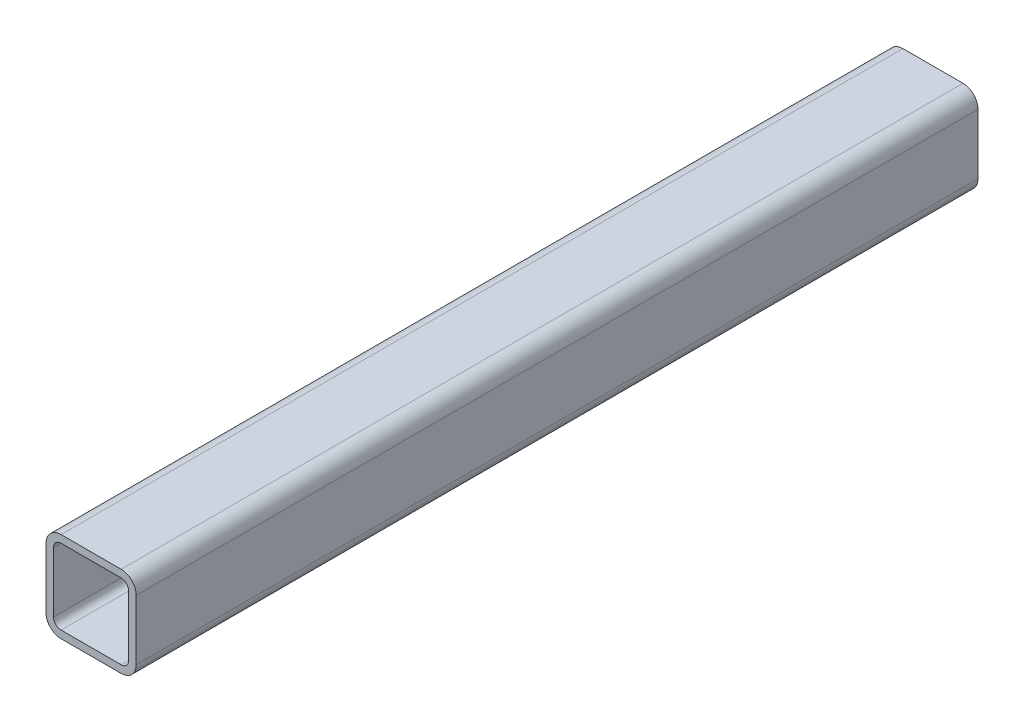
ISO-10303-21;
HEADER;
FILE_DESCRIPTION(('STEP AP214'),'2;1');
FILE_NAME('part.step','',(''),(''),'','','');
FILE_SCHEMA(('AUTOMOTIVE_DESIGN { 1 0 10303 214 1 1 1 1 }'));
ENDSEC;
DATA;
#1=APPLICATION_CONTEXT('core data for automotive mechanical design processes');
#2=APPLICATION_PROTOCOL_DEFINITION('international standard','automotive_design',2000,#1);
#3=PRODUCT_CONTEXT('',#1,'mechanical');
#4=PRODUCT('Part','Part','',(#3));
#5=PRODUCT_RELATED_PRODUCT_CATEGORY('part','',(#4));
#6=PRODUCT_DEFINITION_FORMATION('','',#4);
#7=PRODUCT_DEFINITION_CONTEXT('part definition',#1,'design');
#8=PRODUCT_DEFINITION('design','',#6,#7);
#9=PRODUCT_DEFINITION_SHAPE('','',#8);
#10=(LENGTH_UNIT() NAMED_UNIT(*) SI_UNIT(.MILLI.,.METRE.));
#11=(NAMED_UNIT(*) PLANE_ANGLE_UNIT() SI_UNIT($,.RADIAN.));
#12=(NAMED_UNIT(*) SI_UNIT($,.STERADIAN.) SOLID_ANGLE_UNIT());
#13=UNCERTAINTY_MEASURE_WITH_UNIT(LENGTH_MEASURE(1.E-05),#10,'distance_accuracy_value','');
#14=(GEOMETRIC_REPRESENTATION_CONTEXT(3) GLOBAL_UNCERTAINTY_ASSIGNED_CONTEXT((#13)) GLOBAL_UNIT_ASSIGNED_CONTEXT((#10,
#11,#12)) REPRESENTATION_CONTEXT('',''));
#15=CARTESIAN_POINT('',(0.,0.,0.));
#16=DIRECTION('',(0.,0.,1.));
#17=DIRECTION('',(1.,0.,0.));
#18=AXIS2_PLACEMENT_3D('',#15,#16,#17);
#19=CARTESIAN_POINT('',(-25.4,25.4,711.2));
#20=DIRECTION('',(0.,0.,-1.));
#21=DIRECTION('',(-1.,0.,0.));
#22=AXIS2_PLACEMENT_3D('',#19,#20,#21);
#23=CYLINDRICAL_SURFACE('',#22,12.7);
#24=CARTESIAN_POINT('',(-25.4,25.4,0.));
#25=DIRECTION('',(0.,0.,-1.));
#26=DIRECTION('',(-1.,0.,0.));
#27=AXIS2_PLACEMENT_3D('',#24,#25,#26);
#28=CIRCLE('',#27,12.7);
#29=CARTESIAN_POINT('',(-38.1,25.4,0.));
#30=VERTEX_POINT('',#29);
#31=CARTESIAN_POINT('',(-25.4,38.1,0.));
#32=VERTEX_POINT('',#31);
#33=EDGE_CURVE('E199',#30,#32,#28,.T.);
#34=ORIENTED_EDGE('',*,*,#33,.F.);
#35=DIRECTION('',(0.,0.,-1.));
#36=VECTOR('',#35,1.);
#37=CARTESIAN_POINT('',(-38.1,25.4,711.2));
#38=LINE('',#37,#36);
#39=CARTESIAN_POINT('',(-38.1,25.4,711.2));
#40=VERTEX_POINT('',#39);
#41=EDGE_CURVE('E11',#40,#30,#38,.T.);
#42=ORIENTED_EDGE('',*,*,#41,.F.);
#43=CARTESIAN_POINT('',(-25.4,25.4,711.2));
#44=DIRECTION('',(0.,0.,-1.));
#45=DIRECTION('',(-1.,0.,0.));
#46=AXIS2_PLACEMENT_3D('',#43,#44,#45);
#47=CIRCLE('',#46,12.7);
#48=CARTESIAN_POINT('',(-25.4,38.1,711.2));
#49=VERTEX_POINT('',#48);
#50=EDGE_CURVE('E211',#40,#49,#47,.T.);
#51=ORIENTED_EDGE('',*,*,#50,.T.);
#52=DIRECTION('',(0.,0.,-1.));
#53=VECTOR('',#52,1.);
#54=CARTESIAN_POINT('',(-25.4,38.1,711.2));
#55=LINE('',#54,#53);
#56=EDGE_CURVE('E35',#49,#32,#55,.T.);
#57=ORIENTED_EDGE('',*,*,#56,.T.);
#58=EDGE_LOOP('',(#34,#42,#51,#57));
#59=FACE_BOUND('',#58,.T.);
#60=ADVANCED_FACE('F32',(#59),#23,.T.);
#61=CARTESIAN_POINT('',(-38.1,25.4,711.2));
#62=DIRECTION('',(1.,0.,0.));
#63=DIRECTION('',(0.,1.,0.));
#64=AXIS2_PLACEMENT_3D('',#61,#62,#63);
#65=PLANE('',#64);
#66=DIRECTION('',(0.,-1.,0.));
#67=VECTOR('',#66,1.);
#68=CARTESIAN_POINT('',(-38.1,25.4,0.));
#69=LINE('',#68,#67);
#70=CARTESIAN_POINT('',(-38.1,-25.4,0.));
#71=VERTEX_POINT('',#70);
#72=EDGE_CURVE('E215',#30,#71,#69,.T.);
#73=ORIENTED_EDGE('',*,*,#72,.T.);
#74=DIRECTION('',(0.,0.,-1.));
#75=VECTOR('',#74,1.);
#76=CARTESIAN_POINT('',(-38.1,-25.4,711.2));
#77=LINE('',#76,#75);
#78=CARTESIAN_POINT('',(-38.1,-25.4,711.2));
#79=VERTEX_POINT('',#78);
#80=EDGE_CURVE('E40',#79,#71,#77,.T.);
#81=ORIENTED_EDGE('',*,*,#80,.F.);
#82=DIRECTION('',(0.,-1.,0.));
#83=VECTOR('',#82,1.);
#84=CARTESIAN_POINT('',(-38.1,25.4,711.2));
#85=LINE('',#84,#83);
#86=EDGE_CURVE('E231',#40,#79,#85,.T.);
#87=ORIENTED_EDGE('',*,*,#86,.F.);
#88=ORIENTED_EDGE('',*,*,#41,.T.);
#89=EDGE_LOOP('',(#73,#81,#87,#88));
#90=FACE_BOUND('',#89,.T.);
#91=ADVANCED_FACE('F279',(#90),#65,.F.);
#92=CARTESIAN_POINT('',(-25.4,-25.4,711.2));
#93=DIRECTION('',(0.,0.,-1.));
#94=DIRECTION('',(-1.,0.,0.));
#95=AXIS2_PLACEMENT_3D('',#92,#93,#94);
#96=CYLINDRICAL_SURFACE('',#95,12.7);
#97=CARTESIAN_POINT('',(-25.4,-25.4,0.));
#98=DIRECTION('',(0.,0.,-1.));
#99=DIRECTION('',(-1.,0.,0.));
#100=AXIS2_PLACEMENT_3D('',#97,#98,#99);
#101=CIRCLE('',#100,12.7);
#102=CARTESIAN_POINT('',(-25.4,-38.1,0.));
#103=VERTEX_POINT('',#102);
#104=EDGE_CURVE('E249',#103,#71,#101,.T.);
#105=ORIENTED_EDGE('',*,*,#104,.F.);
#106=DIRECTION('',(0.,0.,-1.));
#107=VECTOR('',#106,1.);
#108=CARTESIAN_POINT('',(-25.4,-38.1,711.2));
#109=LINE('',#108,#107);
#110=CARTESIAN_POINT('',(-25.4,-38.1,711.2));
#111=VERTEX_POINT('',#110);
#112=EDGE_CURVE('E255',#111,#103,#109,.T.);
#113=ORIENTED_EDGE('',*,*,#112,.F.);
#114=CARTESIAN_POINT('',(-25.4,-25.4,711.2));
#115=DIRECTION('',(0.,0.,-1.));
#116=DIRECTION('',(-1.,0.,0.));
#117=AXIS2_PLACEMENT_3D('',#114,#115,#116);
#118=CIRCLE('',#117,12.7);
#119=EDGE_CURVE('E228',#111,#79,#118,.T.);
#120=ORIENTED_EDGE('',*,*,#119,.T.);
#121=ORIENTED_EDGE('',*,*,#80,.T.);
#122=EDGE_LOOP('',(#105,#113,#120,#121));
#123=FACE_BOUND('',#122,.T.);
#124=ADVANCED_FACE('F298',(#123),#96,.T.);
#125=CARTESIAN_POINT('',(25.4,-38.1,711.2));
#126=DIRECTION('',(0.,-1.,0.));
#127=DIRECTION('',(0.,0.,-1.));
#128=AXIS2_PLACEMENT_3D('',#125,#126,#127);
#129=PLANE('',#128);
#130=DIRECTION('',(-1.,0.,0.));
#131=VECTOR('',#130,1.);
#132=CARTESIAN_POINT('',(25.4,-38.1,0.));
#133=LINE('',#132,#131);
#134=CARTESIAN_POINT('',(25.4,-38.1,0.));
#135=VERTEX_POINT('',#134);
#136=EDGE_CURVE('E246',#135,#103,#133,.T.);
#137=ORIENTED_EDGE('',*,*,#136,.F.);
#138=DIRECTION('',(0.,0.,-1.));
#139=VECTOR('',#138,1.);
#140=CARTESIAN_POINT('',(25.4,-38.1,711.2));
#141=LINE('',#140,#139);
#142=CARTESIAN_POINT('',(25.4,-38.1,711.2));
#143=VERTEX_POINT('',#142);
#144=EDGE_CURVE('E257',#143,#135,#141,.T.);
#145=ORIENTED_EDGE('',*,*,#144,.F.);
#146=DIRECTION('',(-1.,0.,0.));
#147=VECTOR('',#146,1.);
#148=CARTESIAN_POINT('',(25.4,-38.1,711.2));
#149=LINE('',#148,#147);
#150=EDGE_CURVE('E225',#143,#111,#149,.T.);
#151=ORIENTED_EDGE('',*,*,#150,.T.);
#152=ORIENTED_EDGE('',*,*,#112,.T.);
#153=EDGE_LOOP('',(#137,#145,#151,#152));
#154=FACE_BOUND('',#153,.T.);
#155=ADVANCED_FACE('F296',(#154),#129,.T.);
#156=CARTESIAN_POINT('',(25.4,-25.4,711.2));
#157=DIRECTION('',(0.,0.,-1.));
#158=DIRECTION('',(-1.,0.,0.));
#159=AXIS2_PLACEMENT_3D('',#156,#157,#158);
#160=CYLINDRICAL_SURFACE('',#159,12.7);
#161=CARTESIAN_POINT('',(25.4,-25.4,0.));
#162=DIRECTION('',(0.,0.,-1.));
#163=DIRECTION('',(-1.,0.,0.));
#164=AXIS2_PLACEMENT_3D('',#161,#162,#163);
#165=CIRCLE('',#164,12.7);
#166=CARTESIAN_POINT('',(38.1,-25.4,0.));
#167=VERTEX_POINT('',#166);
#168=EDGE_CURVE('E243',#167,#135,#165,.T.);
#169=ORIENTED_EDGE('',*,*,#168,.F.);
#170=DIRECTION('',(0.,0.,-1.));
#171=VECTOR('',#170,1.);
#172=CARTESIAN_POINT('',(38.1,-25.4,711.2));
#173=LINE('',#172,#171);
#174=CARTESIAN_POINT('',(38.1,-25.4,711.2));
#175=VERTEX_POINT('',#174);
#176=EDGE_CURVE('E259',#175,#167,#173,.T.);
#177=ORIENTED_EDGE('',*,*,#176,.F.);
#178=CARTESIAN_POINT('',(25.4,-25.4,711.2));
#179=DIRECTION('',(0.,0.,-1.));
#180=DIRECTION('',(-1.,0.,0.));
#181=AXIS2_PLACEMENT_3D('',#178,#179,#180);
#182=CIRCLE('',#181,12.7);
#183=EDGE_CURVE('E222',#175,#143,#182,.T.);
#184=ORIENTED_EDGE('',*,*,#183,.T.);
#185=ORIENTED_EDGE('',*,*,#144,.T.);
#186=EDGE_LOOP('',(#169,#177,#184,#185));
#187=FACE_BOUND('',#186,.T.);
#188=ADVANCED_FACE('F292',(#187),#160,.T.);
#189=CARTESIAN_POINT('',(38.1,-25.4,711.2));
#190=DIRECTION('',(-1.,0.,0.));
#191=DIRECTION('',(0.,0.,1.));
#192=AXIS2_PLACEMENT_3D('',#189,#190,#191);
#193=PLANE('',#192);
#194=DIRECTION('',(0.,1.,0.));
#195=VECTOR('',#194,1.);
#196=CARTESIAN_POINT('',(38.1,-25.4,0.));
#197=LINE('',#196,#195);
#198=CARTESIAN_POINT('',(38.1,25.4,0.));
#199=VERTEX_POINT('',#198);
#200=EDGE_CURVE('E241',#167,#199,#197,.T.);
#201=ORIENTED_EDGE('',*,*,#200,.T.);
#202=DIRECTION('',(0.,0.,-1.));
#203=VECTOR('',#202,1.);
#204=CARTESIAN_POINT('',(38.1,25.4,711.2));
#205=LINE('',#204,#203);
#206=CARTESIAN_POINT('',(38.1,25.4,711.2));
#207=VERTEX_POINT('',#206);
#208=EDGE_CURVE('E261',#207,#199,#205,.T.);
#209=ORIENTED_EDGE('',*,*,#208,.F.);
#210=DIRECTION('',(0.,1.,0.));
#211=VECTOR('',#210,1.);
#212=CARTESIAN_POINT('',(38.1,-25.4,711.2));
#213=LINE('',#212,#211);
#214=EDGE_CURVE('E220',#175,#207,#213,.T.);
#215=ORIENTED_EDGE('',*,*,#214,.F.);
#216=ORIENTED_EDGE('',*,*,#176,.T.);
#217=EDGE_LOOP('',(#201,#209,#215,#216));
#218=FACE_BOUND('',#217,.T.);
#219=ADVANCED_FACE('F333',(#218),#193,.F.);
#220=CARTESIAN_POINT('',(25.4,25.4,711.2));
#221=DIRECTION('',(0.,0.,-1.));
#222=DIRECTION('',(-1.,0.,0.));
#223=AXIS2_PLACEMENT_3D('',#220,#221,#222);
#224=CYLINDRICAL_SURFACE('',#223,12.7);
#225=CARTESIAN_POINT('',(25.4,25.4,0.));
#226=DIRECTION('',(0.,0.,1.));
#227=DIRECTION('',(1.,0.,0.));
#228=AXIS2_PLACEMENT_3D('',#225,#226,#227);
#229=CIRCLE('',#228,12.7);
#230=CARTESIAN_POINT('',(25.4,38.1,0.));
#231=VERTEX_POINT('',#230);
#232=EDGE_CURVE('E238',#199,#231,#229,.T.);
#233=ORIENTED_EDGE('',*,*,#232,.T.);
#234=DIRECTION('',(0.,0.,-1.));
#235=VECTOR('',#234,1.);
#236=CARTESIAN_POINT('',(25.4,38.1,711.2));
#237=LINE('',#236,#235);
#238=CARTESIAN_POINT('',(25.4,38.1,711.2));
#239=VERTEX_POINT('',#238);
#240=EDGE_CURVE('E263',#239,#231,#237,.T.);
#241=ORIENTED_EDGE('',*,*,#240,.F.);
#242=CARTESIAN_POINT('',(25.4,25.4,711.2));
#243=DIRECTION('',(0.,0.,1.));
#244=DIRECTION('',(1.,0.,0.));
#245=AXIS2_PLACEMENT_3D('',#242,#243,#244);
#246=CIRCLE('',#245,12.7);
#247=EDGE_CURVE('E218',#207,#239,#246,.T.);
#248=ORIENTED_EDGE('',*,*,#247,.F.);
#249=ORIENTED_EDGE('',*,*,#208,.T.);
#250=EDGE_LOOP('',(#233,#241,#248,#249));
#251=FACE_BOUND('',#250,.T.);
#252=ADVANCED_FACE('F287',(#251),#224,.T.);
#253=CARTESIAN_POINT('',(-25.4,38.1,711.2));
#254=DIRECTION('',(0.,1.,0.));
#255=DIRECTION('',(0.,0.,1.));
#256=AXIS2_PLACEMENT_3D('',#253,#254,#255);
#257=PLANE('',#256);
#258=DIRECTION('',(1.,0.,0.));
#259=VECTOR('',#258,1.);
#260=CARTESIAN_POINT('',(-25.4,38.1,0.));
#261=LINE('',#260,#259);
#262=EDGE_CURVE('E235',#32,#231,#261,.T.);
#263=ORIENTED_EDGE('',*,*,#262,.F.);
#264=ORIENTED_EDGE('',*,*,#56,.F.);
#265=DIRECTION('',(1.,0.,0.));
#266=VECTOR('',#265,1.);
#267=CARTESIAN_POINT('',(-25.4,38.1,711.2));
#268=LINE('',#267,#266);
#269=EDGE_CURVE('E214',#49,#239,#268,.T.);
#270=ORIENTED_EDGE('',*,*,#269,.T.);
#271=ORIENTED_EDGE('',*,*,#240,.T.);
#272=EDGE_LOOP('',(#263,#264,#270,#271));
#273=FACE_BOUND('',#272,.T.);
#274=ADVANCED_FACE('F271',(#273),#257,.T.);
#275=CARTESIAN_POINT('',(-25.4,25.4,711.2));
#276=DIRECTION('',(0.,0.,-1.));
#277=DIRECTION('',(-1.,0.,0.));
#278=AXIS2_PLACEMENT_3D('',#275,#276,#277);
#279=PLANE('',#278);
#280=DIRECTION('',(0.,-1.,0.));
#281=VECTOR('',#280,1.);
#282=CARTESIAN_POINT('',(-31.75,25.4,711.2));
#283=LINE('',#282,#281);
#284=CARTESIAN_POINT('',(-31.75,25.4,711.2));
#285=VERTEX_POINT('',#284);
#286=CARTESIAN_POINT('',(-31.75,-25.4,711.2));
#287=VERTEX_POINT('',#286);
#288=EDGE_CURVE('E150',#285,#287,#283,.T.);
#289=ORIENTED_EDGE('',*,*,#288,.F.);
#290=CARTESIAN_POINT('',(-25.4,25.4,711.2));
#291=DIRECTION('',(0.,0.,-1.));
#292=DIRECTION('',(-1.,0.,0.));
#293=AXIS2_PLACEMENT_3D('',#290,#291,#292);
#294=CIRCLE('',#293,6.35);
#295=CARTESIAN_POINT('',(-25.4,31.75,711.2));
#296=VERTEX_POINT('',#295);
#297=EDGE_CURVE('E147',#285,#296,#294,.T.);
#298=ORIENTED_EDGE('',*,*,#297,.T.);
#299=DIRECTION('',(1.,0.,0.));
#300=VECTOR('',#299,1.);
#301=CARTESIAN_POINT('',(-25.4,31.75,711.2));
#302=LINE('',#301,#300);
#303=CARTESIAN_POINT('',(25.4,31.75,711.2));
#304=VERTEX_POINT('',#303);
#305=EDGE_CURVE('E153',#296,#304,#302,.T.);
#306=ORIENTED_EDGE('',*,*,#305,.T.);
#307=CARTESIAN_POINT('',(25.4,25.4,711.2));
#308=DIRECTION('',(0.,0.,-1.));
#309=DIRECTION('',(-1.,0.,0.));
#310=AXIS2_PLACEMENT_3D('',#307,#308,#309);
#311=CIRCLE('',#310,6.35000000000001);
#312=CARTESIAN_POINT('',(31.75,25.4,711.2));
#313=VERTEX_POINT('',#312);
#314=EDGE_CURVE('E157',#313,#304,#311,.F.);
#315=ORIENTED_EDGE('',*,*,#314,.F.);
#316=DIRECTION('',(0.,1.,0.));
#317=VECTOR('',#316,1.);
#318=CARTESIAN_POINT('',(31.75,25.4,711.2));
#319=LINE('',#318,#317);
#320=CARTESIAN_POINT('',(31.75,-25.4,711.2));
#321=VERTEX_POINT('',#320);
#322=EDGE_CURVE('E169',#321,#313,#319,.T.);
#323=ORIENTED_EDGE('',*,*,#322,.F.);
#324=CARTESIAN_POINT('',(25.4,-25.4,711.2));
#325=DIRECTION('',(0.,0.,-1.));
#326=DIRECTION('',(-1.,0.,0.));
#327=AXIS2_PLACEMENT_3D('',#324,#325,#326);
#328=CIRCLE('',#327,6.35);
#329=CARTESIAN_POINT('',(25.4,-31.75,711.2));
#330=VERTEX_POINT('',#329);
#331=EDGE_CURVE('E171',#321,#330,#328,.T.);
#332=ORIENTED_EDGE('',*,*,#331,.T.);
#333=DIRECTION('',(-1.,0.,0.));
#334=VECTOR('',#333,1.);
#335=CARTESIAN_POINT('',(-25.4,-31.75,711.2));
#336=LINE('',#335,#334);
#337=CARTESIAN_POINT('',(-25.4,-31.75,711.2));
#338=VERTEX_POINT('',#337);
#339=EDGE_CURVE('E174',#330,#338,#336,.T.);
#340=ORIENTED_EDGE('',*,*,#339,.T.);
#341=CARTESIAN_POINT('',(-25.4,-25.4,711.2));
#342=DIRECTION('',(0.,0.,-1.));
#343=DIRECTION('',(-1.,0.,0.));
#344=AXIS2_PLACEMENT_3D('',#341,#342,#343);
#345=CIRCLE('',#344,6.35000000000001);
#346=EDGE_CURVE('E177',#338,#287,#345,.T.);
#347=ORIENTED_EDGE('',*,*,#346,.T.);
#348=EDGE_LOOP('',(#289,#298,#306,#315,#323,#332,#340,#347));
#349=FACE_BOUND('',#348,.T.);
#350=ORIENTED_EDGE('',*,*,#50,.F.);
#351=ORIENTED_EDGE('',*,*,#86,.T.);
#352=ORIENTED_EDGE('',*,*,#119,.F.);
#353=ORIENTED_EDGE('',*,*,#150,.F.);
#354=ORIENTED_EDGE('',*,*,#183,.F.);
#355=ORIENTED_EDGE('',*,*,#214,.T.);
#356=ORIENTED_EDGE('',*,*,#247,.T.);
#357=ORIENTED_EDGE('',*,*,#269,.F.);
#358=EDGE_LOOP('',(#350,#351,#352,#353,#354,#355,#356,#357));
#359=FACE_BOUND('',#358,.T.);
#360=ADVANCED_FACE('F159',(#349,#359),#279,.F.);
#361=CARTESIAN_POINT('',(-25.4,25.4,0.));
#362=DIRECTION('',(0.,0.,-1.));
#363=DIRECTION('',(-1.,0.,0.));
#364=AXIS2_PLACEMENT_3D('',#361,#362,#363);
#365=PLANE('',#364);
#366=CARTESIAN_POINT('',(-25.4,25.4,0.));
#367=DIRECTION('',(0.,0.,-1.));
#368=DIRECTION('',(-1.,0.,0.));
#369=AXIS2_PLACEMENT_3D('',#366,#367,#368);
#370=CIRCLE('',#369,6.35);
#371=CARTESIAN_POINT('',(-31.75,25.4,0.));
#372=VERTEX_POINT('',#371);
#373=CARTESIAN_POINT('',(-25.4,31.75,0.));
#374=VERTEX_POINT('',#373);
#375=EDGE_CURVE('E56',#372,#374,#370,.T.);
#376=ORIENTED_EDGE('',*,*,#375,.F.);
#377=DIRECTION('',(0.,-1.,0.));
#378=VECTOR('',#377,1.);
#379=CARTESIAN_POINT('',(-31.75,25.4,0.));
#380=LINE('',#379,#378);
#381=CARTESIAN_POINT('',(-31.75,-25.4,0.));
#382=VERTEX_POINT('',#381);
#383=EDGE_CURVE('E162',#372,#382,#380,.T.);
#384=ORIENTED_EDGE('',*,*,#383,.T.);
#385=CARTESIAN_POINT('',(-25.4,-25.4,0.));
#386=DIRECTION('',(0.,0.,-1.));
#387=DIRECTION('',(-1.,0.,0.));
#388=AXIS2_PLACEMENT_3D('',#385,#386,#387);
#389=CIRCLE('',#388,6.35000000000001);
#390=CARTESIAN_POINT('',(-25.4,-31.75,0.));
#391=VERTEX_POINT('',#390);
#392=EDGE_CURVE('E165',#391,#382,#389,.T.);
#393=ORIENTED_EDGE('',*,*,#392,.F.);
#394=DIRECTION('',(-1.,0.,0.));
#395=VECTOR('',#394,1.);
#396=CARTESIAN_POINT('',(-25.4,-31.75,0.));
#397=LINE('',#396,#395);
#398=CARTESIAN_POINT('',(25.4,-31.75,0.));
#399=VERTEX_POINT('',#398);
#400=EDGE_CURVE('E192',#399,#391,#397,.T.);
#401=ORIENTED_EDGE('',*,*,#400,.F.);
#402=CARTESIAN_POINT('',(25.4,-25.4,0.));
#403=DIRECTION('',(0.,0.,-1.));
#404=DIRECTION('',(-1.,0.,0.));
#405=AXIS2_PLACEMENT_3D('',#402,#403,#404);
#406=CIRCLE('',#405,6.35);
#407=CARTESIAN_POINT('',(31.75,-25.4,0.));
#408=VERTEX_POINT('',#407);
#409=EDGE_CURVE('E189',#408,#399,#406,.T.);
#410=ORIENTED_EDGE('',*,*,#409,.F.);
#411=DIRECTION('',(0.,1.,0.));
#412=VECTOR('',#411,1.);
#413=CARTESIAN_POINT('',(31.75,25.4,0.));
#414=LINE('',#413,#412);
#415=CARTESIAN_POINT('',(31.75,25.4,0.));
#416=VERTEX_POINT('',#415);
#417=EDGE_CURVE('E186',#408,#416,#414,.T.);
#418=ORIENTED_EDGE('',*,*,#417,.T.);
#419=CARTESIAN_POINT('',(25.4,25.4,0.));
#420=DIRECTION('',(0.,0.,-1.));
#421=DIRECTION('',(-1.,0.,0.));
#422=AXIS2_PLACEMENT_3D('',#419,#420,#421);
#423=CIRCLE('',#422,6.35000000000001);
#424=CARTESIAN_POINT('',(25.4,31.75,0.));
#425=VERTEX_POINT('',#424);
#426=EDGE_CURVE('E183',#416,#425,#423,.F.);
#427=ORIENTED_EDGE('',*,*,#426,.T.);
#428=DIRECTION('',(1.,0.,0.));
#429=VECTOR('',#428,1.);
#430=CARTESIAN_POINT('',(-25.4,31.75,0.));
#431=LINE('',#430,#429);
#432=EDGE_CURVE('E181',#374,#425,#431,.T.);
#433=ORIENTED_EDGE('',*,*,#432,.F.);
#434=EDGE_LOOP('',(#376,#384,#393,#401,#410,#418,#427,#433));
#435=FACE_BOUND('',#434,.T.);
#436=ORIENTED_EDGE('',*,*,#33,.T.);
#437=ORIENTED_EDGE('',*,*,#262,.T.);
#438=ORIENTED_EDGE('',*,*,#232,.F.);
#439=ORIENTED_EDGE('',*,*,#200,.F.);
#440=ORIENTED_EDGE('',*,*,#168,.T.);
#441=ORIENTED_EDGE('',*,*,#136,.T.);
#442=ORIENTED_EDGE('',*,*,#104,.T.);
#443=ORIENTED_EDGE('',*,*,#72,.F.);
#444=EDGE_LOOP('',(#436,#437,#438,#439,#440,#441,#442,#443));
#445=FACE_BOUND('',#444,.T.);
#446=ADVANCED_FACE('F275',(#435,#445),#365,.T.);
#447=CARTESIAN_POINT('',(-25.4,25.4,711.2));
#448=DIRECTION('',(0.,0.,-1.));
#449=DIRECTION('',(-1.,0.,0.));
#450=AXIS2_PLACEMENT_3D('',#447,#448,#449);
#451=CYLINDRICAL_SURFACE('',#450,6.35);
#452=ORIENTED_EDGE('',*,*,#375,.T.);
#453=DIRECTION('',(0.,0.,-1.));
#454=VECTOR('',#453,1.);
#455=CARTESIAN_POINT('',(-25.4,31.75,711.2));
#456=LINE('',#455,#454);
#457=EDGE_CURVE('E144',#296,#374,#456,.T.);
#458=ORIENTED_EDGE('',*,*,#457,.F.);
#459=ORIENTED_EDGE('',*,*,#297,.F.);
#460=DIRECTION('',(0.,0.,-1.));
#461=VECTOR('',#460,1.);
#462=CARTESIAN_POINT('',(-31.75,25.4,711.2));
#463=LINE('',#462,#461);
#464=EDGE_CURVE('E197',#285,#372,#463,.T.);
#465=ORIENTED_EDGE('',*,*,#464,.T.);
#466=EDGE_LOOP('',(#452,#458,#459,#465));
#467=FACE_BOUND('',#466,.T.);
#468=ADVANCED_FACE('F145',(#467),#451,.F.);
#469=CARTESIAN_POINT('',(-31.75,25.4,711.2));
#470=DIRECTION('',(1.,0.,0.));
#471=DIRECTION('',(0.,1.,0.));
#472=AXIS2_PLACEMENT_3D('',#469,#470,#471);
#473=PLANE('',#472);
#474=ORIENTED_EDGE('',*,*,#383,.F.);
#475=ORIENTED_EDGE('',*,*,#464,.F.);
#476=ORIENTED_EDGE('',*,*,#288,.T.);
#477=DIRECTION('',(0.,0.,-1.));
#478=VECTOR('',#477,1.);
#479=CARTESIAN_POINT('',(-31.75,-25.4,711.2));
#480=LINE('',#479,#478);
#481=EDGE_CURVE('E200',#287,#382,#480,.T.);
#482=ORIENTED_EDGE('',*,*,#481,.T.);
#483=EDGE_LOOP('',(#474,#475,#476,#482));
#484=FACE_BOUND('',#483,.T.);
#485=ADVANCED_FACE('F382',(#484),#473,.T.);
#486=CARTESIAN_POINT('',(-25.4,-25.4,711.2));
#487=DIRECTION('',(0.,0.,-1.));
#488=DIRECTION('',(-1.,0.,0.));
#489=AXIS2_PLACEMENT_3D('',#486,#487,#488);
#490=CYLINDRICAL_SURFACE('',#489,6.35000000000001);
#491=ORIENTED_EDGE('',*,*,#392,.T.);
#492=ORIENTED_EDGE('',*,*,#481,.F.);
#493=ORIENTED_EDGE('',*,*,#346,.F.);
#494=DIRECTION('',(0.,0.,-1.));
#495=VECTOR('',#494,1.);
#496=CARTESIAN_POINT('',(-25.4,-31.75,711.2));
#497=LINE('',#496,#495);
#498=EDGE_CURVE('E202',#338,#391,#497,.T.);
#499=ORIENTED_EDGE('',*,*,#498,.T.);
#500=EDGE_LOOP('',(#491,#492,#493,#499));
#501=FACE_BOUND('',#500,.T.);
#502=ADVANCED_FACE('F391',(#501),#490,.F.);
#503=CARTESIAN_POINT('',(-25.4,-31.75,711.2));
#504=DIRECTION('',(0.,-1.,0.));
#505=DIRECTION('',(0.,0.,-1.));
#506=AXIS2_PLACEMENT_3D('',#503,#504,#505);
#507=PLANE('',#506);
#508=ORIENTED_EDGE('',*,*,#400,.T.);
#509=ORIENTED_EDGE('',*,*,#498,.F.);
#510=ORIENTED_EDGE('',*,*,#339,.F.);
#511=DIRECTION('',(0.,0.,-1.));
#512=VECTOR('',#511,1.);
#513=CARTESIAN_POINT('',(25.4,-31.75,711.2));
#514=LINE('',#513,#512);
#515=EDGE_CURVE('E204',#330,#399,#514,.T.);
#516=ORIENTED_EDGE('',*,*,#515,.T.);
#517=EDGE_LOOP('',(#508,#509,#510,#516));
#518=FACE_BOUND('',#517,.T.);
#519=ADVANCED_FACE('F401',(#518),#507,.F.);
#520=CARTESIAN_POINT('',(25.4,-25.4,711.2));
#521=DIRECTION('',(0.,0.,-1.));
#522=DIRECTION('',(-1.,0.,0.));
#523=AXIS2_PLACEMENT_3D('',#520,#521,#522);
#524=CYLINDRICAL_SURFACE('',#523,6.35);
#525=ORIENTED_EDGE('',*,*,#409,.T.);
#526=ORIENTED_EDGE('',*,*,#515,.F.);
#527=ORIENTED_EDGE('',*,*,#331,.F.);
#528=DIRECTION('',(0.,0.,-1.));
#529=VECTOR('',#528,1.);
#530=CARTESIAN_POINT('',(31.75,-25.4,711.2));
#531=LINE('',#530,#529);
#532=EDGE_CURVE('E206',#321,#408,#531,.T.);
#533=ORIENTED_EDGE('',*,*,#532,.T.);
#534=EDGE_LOOP('',(#525,#526,#527,#533));
#535=FACE_BOUND('',#534,.T.);
#536=ADVANCED_FACE('F411',(#535),#524,.F.);
#537=CARTESIAN_POINT('',(31.75,25.4,711.2));
#538=DIRECTION('',(-1.,0.,0.));
#539=DIRECTION('',(0.,0.,1.));
#540=AXIS2_PLACEMENT_3D('',#537,#538,#539);
#541=PLANE('',#540);
#542=ORIENTED_EDGE('',*,*,#417,.F.);
#543=ORIENTED_EDGE('',*,*,#532,.F.);
#544=ORIENTED_EDGE('',*,*,#322,.T.);
#545=DIRECTION('',(0.,0.,-1.));
#546=VECTOR('',#545,1.);
#547=CARTESIAN_POINT('',(31.75,25.4,711.2));
#548=LINE('',#547,#546);
#549=EDGE_CURVE('E208',#313,#416,#548,.T.);
#550=ORIENTED_EDGE('',*,*,#549,.T.);
#551=EDGE_LOOP('',(#542,#543,#544,#550));
#552=FACE_BOUND('',#551,.T.);
#553=ADVANCED_FACE('F421',(#552),#541,.T.);
#554=CARTESIAN_POINT('',(25.4,25.4,711.2));
#555=DIRECTION('',(0.,0.,-1.));
#556=DIRECTION('',(-1.,0.,0.));
#557=AXIS2_PLACEMENT_3D('',#554,#555,#556);
#558=CYLINDRICAL_SURFACE('',#557,6.35000000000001);
#559=ORIENTED_EDGE('',*,*,#426,.F.);
#560=ORIENTED_EDGE('',*,*,#549,.F.);
#561=ORIENTED_EDGE('',*,*,#314,.T.);
#562=DIRECTION('',(0.,0.,-1.));
#563=VECTOR('',#562,1.);
#564=CARTESIAN_POINT('',(25.4,31.75,711.2));
#565=LINE('',#564,#563);
#566=EDGE_CURVE('E48',#304,#425,#565,.T.);
#567=ORIENTED_EDGE('',*,*,#566,.T.);
#568=EDGE_LOOP('',(#559,#560,#561,#567));
#569=FACE_BOUND('',#568,.T.);
#570=ADVANCED_FACE('F431',(#569),#558,.F.);
#571=CARTESIAN_POINT('',(-25.4,31.75,711.2));
#572=DIRECTION('',(0.,1.,0.));
#573=DIRECTION('',(0.,0.,1.));
#574=AXIS2_PLACEMENT_3D('',#571,#572,#573);
#575=PLANE('',#574);
#576=ORIENTED_EDGE('',*,*,#432,.T.);
#577=ORIENTED_EDGE('',*,*,#566,.F.);
#578=ORIENTED_EDGE('',*,*,#305,.F.);
#579=ORIENTED_EDGE('',*,*,#457,.T.);
#580=EDGE_LOOP('',(#576,#577,#578,#579));
#581=FACE_BOUND('',#580,.T.);
#582=ADVANCED_FACE('F154',(#581),#575,.F.);
#583=CLOSED_SHELL('',(#60,#91,#124,#155,#188,#219,#252,#274,#360,#446,#468,#485,#502,#519,#536,
#553,#570,#582));
#584=MANIFOLD_SOLID_BREP('B2',#583);
#585=ADVANCED_BREP_SHAPE_REPRESENTATION('',(#18,#584),#14);
#586=SHAPE_DEFINITION_REPRESENTATION(#9,#585);
ENDSEC;
END-ISO-10303-21;
